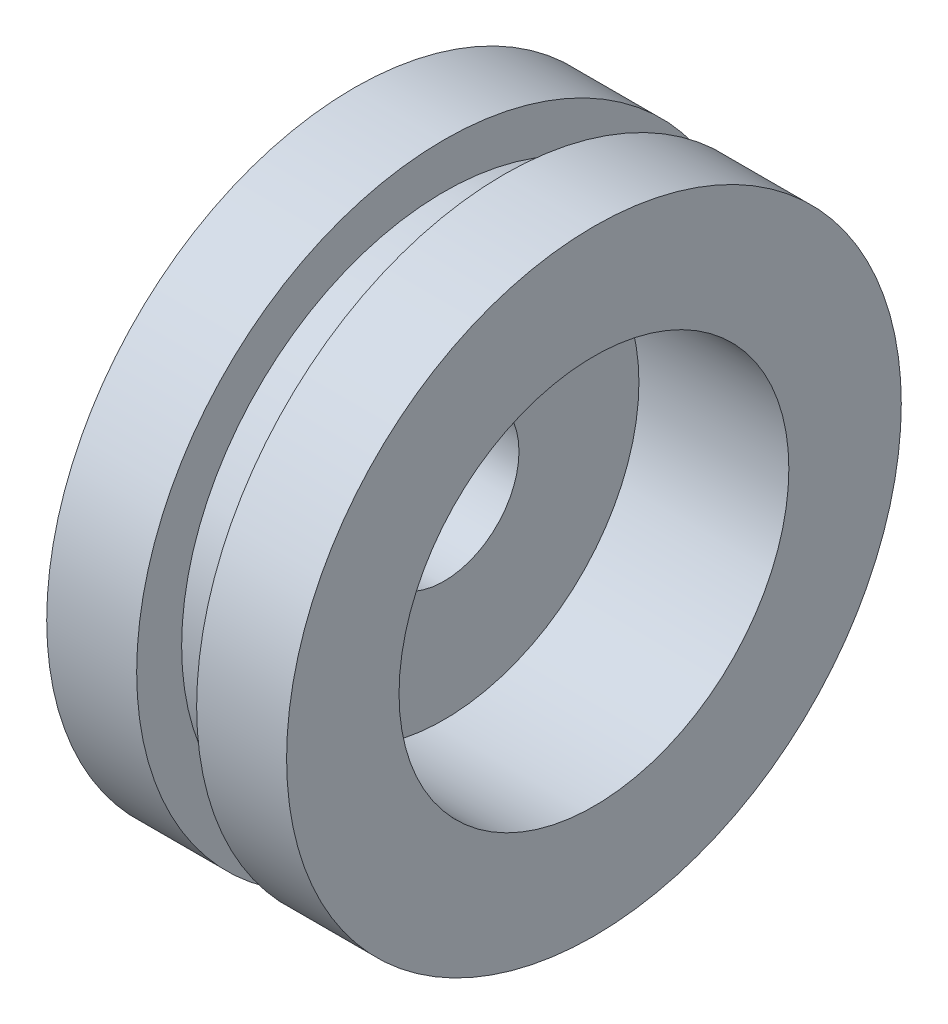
from build123d import *

# Parameters (mm, degrees)
ESQUISSE1_R             = 20.5
BASE_EXTRUSION_DEPTH    = 16
ESQUISSE2_R             = 13
ENL_V_MAT_EXTRU_1_DEPTH = 10
ESQUISSE3_R             = 5
ENL_V_MAT_EXTRU_2_DEPTH = 31.66757245
ESQUISSE4_W             = 4
ESQUISSE4_H             = 12.5


with BuildPart() as part:
    # Esquisse1 → Base-Extrusion (new body)
    with BuildSketch(Plane(origin=(0, 0, 0), x_dir=(0, 0, -1), z_dir=(1, 0, 0))):
        with Locations(Location((0, 0, 0), (0, 0, 180))):
            Circle(ESQUISSE1_R)
    extrude(amount=BASE_EXTRUSION_DEPTH)

    # Esquisse2 → Enl_v. mat.-Extru.1 (cut)
    with BuildSketch(Plane(origin=(16, 0, 0), x_dir=(0, 0, -1), z_dir=(1, 0, 0))):
        Circle(ESQUISSE2_R)
    extrude(amount=-ENL_V_MAT_EXTRU_1_DEPTH, mode=Mode.SUBTRACT)

    # Esquisse3 → Enl_v. mat.-Extru.2 (cut, through all)
    with BuildSketch(Plane(origin=(6, 0, 0), x_dir=(0, 0, -1), z_dir=(1, 0, 0))):
        Circle(ESQUISSE3_R)
    extrude(amount=-ENL_V_MAT_EXTRU_2_DEPTH, mode=Mode.SUBTRACT)

    # Esquisse4 → Enlever de la mati_re-Pivoter1 (revolve, cut)
    with BuildSketch(Plane.XY, mode=Mode.PRIVATE) as enlever_de_la_mati_re_pivoter1_sk:
        with Locations((8, 23.75)):
            Rectangle(ESQUISSE4_W, ESQUISSE4_H)
    revolve(enlever_de_la_mati_re_pivoter1_sk.sketch.rotate(Axis((-8.242378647, 0, 0), (1, 0, 0)), 90), axis=Axis((-8.242378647, 0, 0), (1, 0, 0)), mode=Mode.SUBTRACT)


solid = part.part
